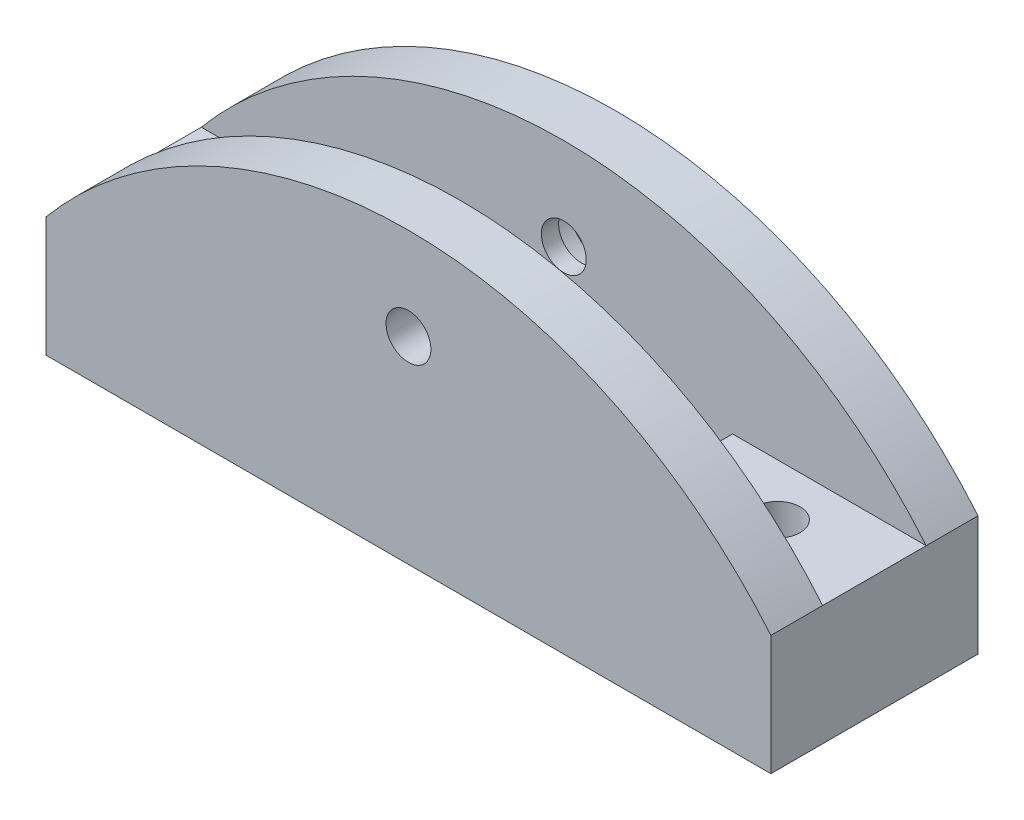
from build123d import *

# Parameters (mm, degrees)
SKETCH1_W           = 42
SKETCH1_H           = 12
BOSS_EXTRUDE1_DEPTH = 6.94
SKETCH2_R           = 10.770265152
CUT_EXTRUDE1_DEPTH  = 26.162742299
BOSS_EXTRUDE2_DEPTH = 3
SKETCH4_R           = 1.3
CUT_EXTRUDE2_DEPTH  = 24.950551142
SKETCH5_R           = 1.3
CUT_EXTRUDE3_DEPTH  = 30.431834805
SKETCH6_R           = 3
CUT_EXTRUDE4_DEPTH  = 2


with BuildPart() as part:
    # Sketch1 → Boss-Extrude1 (new body)
    with BuildSketch(Plane(origin=(0, 0, 0), x_dir=(1, 0, 0), z_dir=(0, 1, 0))):
        Rectangle(SKETCH1_W, SKETCH1_H)
    extrude(amount=BOSS_EXTRUDE1_DEPTH)

    # Sketch2 → Cut-Extrude1 (cut, through all)
    with BuildSketch(Plane.XY.offset(6)):
        with Locations((0, 11.440265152)):
            Circle(SKETCH2_R)
    extrude(amount=-CUT_EXTRUDE1_DEPTH, mode=Mode.SUBTRACT)

    # Sketch3 → Boss-Extrude2 (add)
    with BuildSketch(Plane.XY.offset(6)):
        with BuildLine():
            Line((-21, 6.94), (-21, 0))
            Line((-21, 0), (21, 0))
            Line((21, 0), (21, 6.94))
            ThreePointArc((21, 6.94), (0, 16.77), (-21, 6.94))
        make_face()
    boss_extrude2 = extrude(amount=-BOSS_EXTRUDE2_DEPTH)

    # Mirror1: Boss-Extrude2 across plane
    add(boss_extrude2.mirror(Plane.XY))

    # Sketch4 → Cut-Extrude2 (cut, through all)
    with BuildSketch(Plane(origin=(0, 6.94, 0), x_dir=(1, 0, 0), z_dir=(0, 1, 0))):
        with Locations(Location((-15.3925, 0, 0), (0, 0, 270))):
            Circle(SKETCH4_R)
        with Locations(Location((15.3925, 0, 0), (0, 0, 270))):
            Circle(SKETCH4_R)
    extrude(amount=-CUT_EXTRUDE2_DEPTH, mode=Mode.SUBTRACT)

    # Sketch5 → Cut-Extrude3 (cut, through all)
    with BuildSketch(Plane.XY.offset(6)):
        with Locations((0, 11.44)):
            Circle(SKETCH5_R)
    extrude(amount=-CUT_EXTRUDE3_DEPTH, mode=Mode.SUBTRACT)

    # Sketch6 → Cut-Extrude4 (cut)
    with BuildSketch(Plane(origin=(0, 0, -6), x_dir=(-1, 0, 0), z_dir=(0, 0, -1))):
        with Locations((0, 11.44)):
            Circle(SKETCH6_R)
    extrude(amount=-CUT_EXTRUDE4_DEPTH, mode=Mode.SUBTRACT)


solid = part.part
